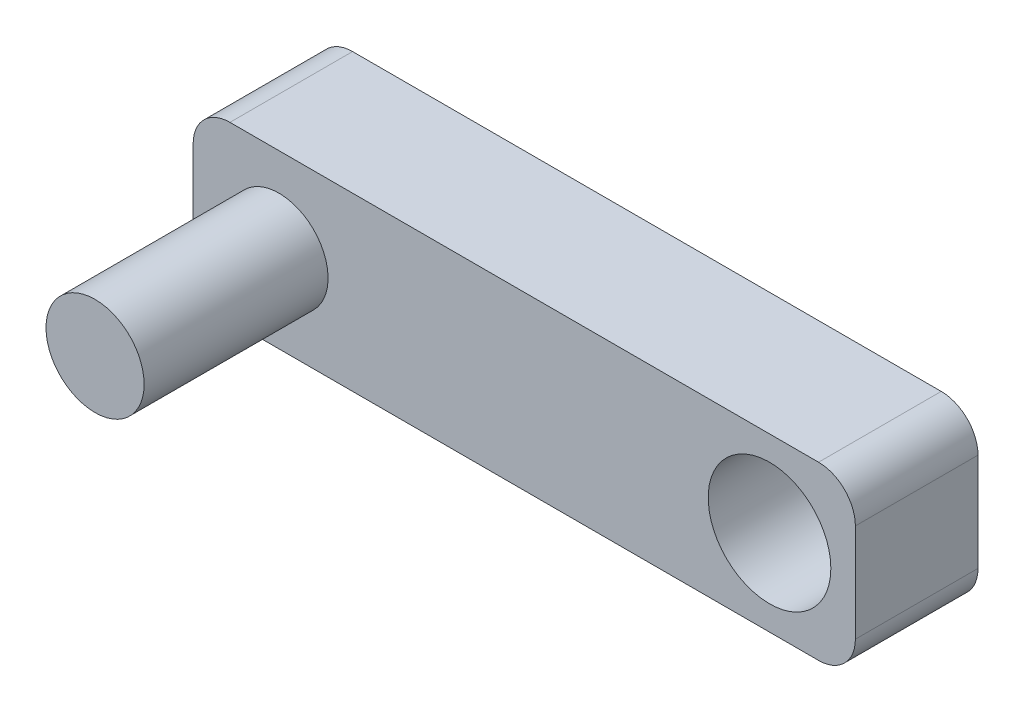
from build123d import *

# Parameters (mm, degrees)
SKETCH_1_W          = 540
SKETCH_1_H          = 140
EXTRUDE_1_DEPTH     = 100
SKETCH_2_R          = 50
CUT_EXTRUDE_2_DEPTH = 567.745092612
SKETCH_3_R          = 40
EXTRUDE_3_DEPTH     = 150
FILLET_1_R          = 30


with BuildPart() as part:
    # Sketch 1 → Extrude 1 (new body)
    with BuildSketch(Plane.XY):
        with Locations((270, 70)):
            Rectangle(SKETCH_1_W, SKETCH_1_H)
    extrude(amount=EXTRUDE_1_DEPTH)

    # Sketch 2 → Cut-Extrude 2 (cut, through all)
    with BuildSketch(Plane.XY.offset(100)):
        with Locations((470, 70)):
            Circle(SKETCH_2_R)
    extrude(amount=-CUT_EXTRUDE_2_DEPTH, mode=Mode.SUBTRACT)

    # Sketch 3 → Extrude 3 (add)
    with BuildSketch(Plane.XY.offset(100)):
        with Locations(Location((70, 70, 0), (0, 0, 180))):
            Circle(SKETCH_3_R)
    extrude(amount=EXTRUDE_3_DEPTH)

    # Fillet 1
    fillet_1_edges = [part.edges().sort_by_distance(p)[0] for p in [
        (0, 140, 50),
        (540, 140, 50),
        (540, 0, 50),
        (0, 0, 50),
    ]]
    fillet(fillet_1_edges, radius=FILLET_1_R)


solid = part.part
